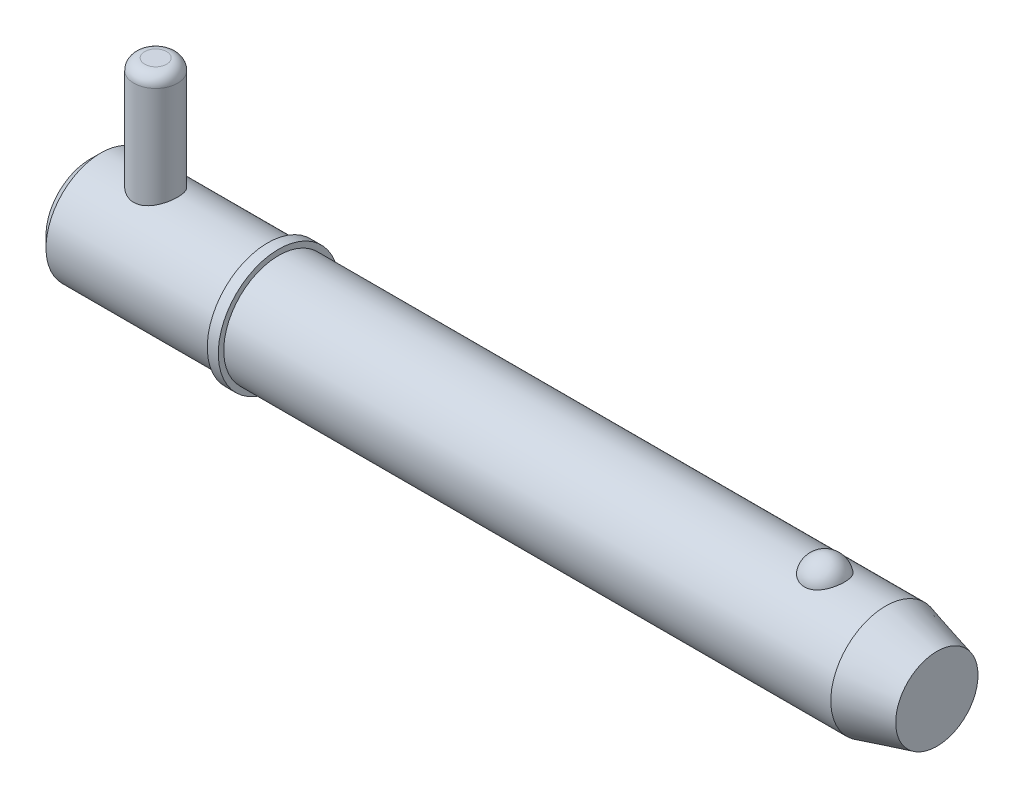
ISO-10303-21;
HEADER;
FILE_DESCRIPTION(('STEP AP214'),'2;1');
FILE_NAME('part.step','',(''),(''),'','','');
FILE_SCHEMA(('AUTOMOTIVE_DESIGN { 1 0 10303 214 1 1 1 1 }'));
ENDSEC;
DATA;
#1=APPLICATION_CONTEXT('core data for automotive mechanical design processes');
#2=APPLICATION_PROTOCOL_DEFINITION('international standard','automotive_design',2000,#1);
#3=PRODUCT_CONTEXT('',#1,'mechanical');
#4=PRODUCT('Part','Part','',(#3));
#5=PRODUCT_RELATED_PRODUCT_CATEGORY('part','',(#4));
#6=PRODUCT_DEFINITION_FORMATION('','',#4);
#7=PRODUCT_DEFINITION_CONTEXT('part definition',#1,'design');
#8=PRODUCT_DEFINITION('design','',#6,#7);
#9=PRODUCT_DEFINITION_SHAPE('','',#8);
#10=(LENGTH_UNIT() NAMED_UNIT(*) SI_UNIT(.MILLI.,.METRE.));
#11=(NAMED_UNIT(*) PLANE_ANGLE_UNIT() SI_UNIT($,.RADIAN.));
#12=(NAMED_UNIT(*) SI_UNIT($,.STERADIAN.) SOLID_ANGLE_UNIT());
#13=UNCERTAINTY_MEASURE_WITH_UNIT(LENGTH_MEASURE(1.E-05),#10,'distance_accuracy_value','');
#14=(GEOMETRIC_REPRESENTATION_CONTEXT(3) GLOBAL_UNCERTAINTY_ASSIGNED_CONTEXT((#13)) GLOBAL_UNIT_ASSIGNED_CONTEXT((#10,
#11,#12)) REPRESENTATION_CONTEXT('',''));
#15=CARTESIAN_POINT('',(0.,0.,0.));
#16=DIRECTION('',(0.,0.,1.));
#17=DIRECTION('',(1.,0.,0.));
#18=AXIS2_PLACEMENT_3D('',#15,#16,#17);
#19=CARTESIAN_POINT('',(9.525,23.81,0.));
#20=DIRECTION('',(0.,-1.,0.));
#21=DIRECTION('',(0.,0.,-1.));
#22=AXIS2_PLACEMENT_3D('',#19,#20,#21);
#23=CYLINDRICAL_SURFACE('',#22,3.175);
#24=CARTESIAN_POINT('',(9.525,-6.3525,0.));
#25=DIRECTION('',(0.,1.,0.));
#26=DIRECTION('',(0.,0.,1.));
#27=AXIS2_PLACEMENT_3D('',#24,#25,#26);
#28=CIRCLE('',#27,3.175);
#29=CARTESIAN_POINT('',(9.525,-6.3525,3.175));
#30=VERTEX_POINT('',#29);
#31=EDGE_CURVE('P0_E25',#30,#30,#28,.T.);
#32=ORIENTED_EDGE('',*,*,#31,.T.);
#33=EDGE_LOOP('',(#32));
#34=FACE_BOUND('',#33,.T.);
#35=CARTESIAN_POINT('',(9.525,22.2225,0.));
#36=DIRECTION('',(0.,1.,0.));
#37=DIRECTION('',(0.,0.,1.));
#38=AXIS2_PLACEMENT_3D('',#35,#36,#37);
#39=CIRCLE('',#38,3.175);
#40=CARTESIAN_POINT('',(9.525,22.2225,3.175));
#41=VERTEX_POINT('',#40);
#42=EDGE_CURVE('P0_E29',#41,#41,#39,.F.);
#43=ORIENTED_EDGE('',*,*,#42,.T.);
#44=EDGE_LOOP('',(#43));
#45=FACE_BOUND('',#44,.T.);
#46=ADVANCED_FACE('P0_F14',(#34,#45),#23,.T.);
#47=CARTESIAN_POINT('',(9.525,23.81,0.));
#48=DIRECTION('',(0.,1.,0.));
#49=DIRECTION('',(0.,0.,1.));
#50=AXIS2_PLACEMENT_3D('',#47,#48,#49);
#51=PLANE('',#50);
#52=CARTESIAN_POINT('',(9.525,23.81,0.));
#53=DIRECTION('',(0.,1.,0.));
#54=DIRECTION('',(0.,0.,1.));
#55=AXIS2_PLACEMENT_3D('',#52,#53,#54);
#56=CIRCLE('',#55,1.5875);
#57=CARTESIAN_POINT('',(9.525,23.81,1.5875));
#58=VERTEX_POINT('',#57);
#59=EDGE_CURVE('P0_E10',#58,#58,#56,.T.);
#60=ORIENTED_EDGE('',*,*,#59,.T.);
#61=EDGE_LOOP('',(#60));
#62=FACE_BOUND('',#61,.T.);
#63=ADVANCED_FACE('P0_F46',(#62),#51,.T.);
#64=CARTESIAN_POINT('',(9.525,-7.94,0.));
#65=DIRECTION('',(0.,1.,0.));
#66=DIRECTION('',(0.,0.,1.));
#67=AXIS2_PLACEMENT_3D('',#64,#65,#66);
#68=PLANE('',#67);
#69=CARTESIAN_POINT('',(9.525,-7.94,0.));
#70=DIRECTION('',(0.,1.,0.));
#71=DIRECTION('',(0.,0.,1.));
#72=AXIS2_PLACEMENT_3D('',#69,#70,#71);
#73=CIRCLE('',#72,1.5875);
#74=CARTESIAN_POINT('',(9.525,-7.94,1.5875));
#75=VERTEX_POINT('',#74);
#76=EDGE_CURVE('P0_E21',#75,#75,#73,.F.);
#77=ORIENTED_EDGE('',*,*,#76,.T.);
#78=EDGE_LOOP('',(#77));
#79=FACE_BOUND('',#78,.T.);
#80=ADVANCED_FACE('P0_F43',(#79),#68,.F.);
#81=CARTESIAN_POINT('',(9.525,-6.3525,0.));
#82=DIRECTION('',(0.,1.,0.));
#83=DIRECTION('',(0.,0.,1.));
#84=AXIS2_PLACEMENT_3D('',#81,#82,#83);
#85=DEGENERATE_TOROIDAL_SURFACE('',#84,1.5875,1.5875,.T.);
#86=ORIENTED_EDGE('',*,*,#76,.F.);
#87=EDGE_LOOP('',(#86));
#88=FACE_BOUND('',#87,.T.);
#89=ORIENTED_EDGE('',*,*,#31,.F.);
#90=EDGE_LOOP('',(#89));
#91=FACE_BOUND('',#90,.T.);
#92=ADVANCED_FACE('P0_F38',(#88,#91),#85,.T.);
#93=CARTESIAN_POINT('',(9.525,22.2225,0.));
#94=DIRECTION('',(0.,1.,0.));
#95=DIRECTION('',(0.,0.,1.));
#96=AXIS2_PLACEMENT_3D('',#93,#94,#95);
#97=DEGENERATE_TOROIDAL_SURFACE('',#96,1.5875,1.5875,.T.);
#98=ORIENTED_EDGE('',*,*,#42,.F.);
#99=EDGE_LOOP('',(#98));
#100=FACE_BOUND('',#99,.T.);
#101=ORIENTED_EDGE('',*,*,#59,.F.);
#102=EDGE_LOOP('',(#101));
#103=FACE_BOUND('',#102,.T.);
#104=ADVANCED_FACE('P0_F16',(#100,#103),#97,.T.);
#105=CLOSED_SHELL('',(#46,#63,#80,#92,#104));
#106=MANIFOLD_SOLID_BREP('P0_B1',#105);
#107=CARTESIAN_POINT('',(0.,0.,0.));
#108=DIRECTION('',(1.,0.,0.));
#109=DIRECTION('',(0.,0.,-1.));
#110=AXIS2_PLACEMENT_3D('',#107,#108,#109);
#111=CYLINDRICAL_SURFACE('',#110,7.94);
#112=CARTESIAN_POINT('',(115.151879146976,0.,0.));
#113=DIRECTION('',(1.,0.,0.));
#114=DIRECTION('',(0.,0.,-1.));
#115=AXIS2_PLACEMENT_3D('',#112,#113,#114);
#116=CIRCLE('',#115,7.94);
#117=CARTESIAN_POINT('',(115.151879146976,0.,-7.94));
#118=VERTEX_POINT('',#117);
#119=EDGE_CURVE('P1_E81',#118,#118,#116,.T.);
#120=ORIENTED_EDGE('',*,*,#119,.F.);
#121=EDGE_LOOP('',(#120));
#122=FACE_BOUND('',#121,.T.);
#123=CARTESIAN_POINT('',(27.31,0.,0.));
#124=DIRECTION('',(1.,0.,0.));
#125=DIRECTION('',(0.,0.,-1.));
#126=AXIS2_PLACEMENT_3D('',#123,#124,#125);
#127=CIRCLE('',#126,7.94);
#128=CARTESIAN_POINT('',(27.31,0.,-7.94));
#129=VERTEX_POINT('',#128);
#130=EDGE_CURVE('P1_E85',#129,#129,#127,.T.);
#131=ORIENTED_EDGE('',*,*,#130,.T.);
#132=EDGE_LOOP('',(#131));
#133=FACE_BOUND('',#132,.T.);
#134=CARTESIAN_POINT('',(106.344907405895,7.37767842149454,2.93486986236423));
#135=CARTESIAN_POINT('',(106.192749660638,7.3776732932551,2.93487505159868));
#136=CARTESIAN_POINT('',(106.040632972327,7.38258419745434,2.92262454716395));
#137=CARTESIAN_POINT('',(105.740928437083,7.40163229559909,2.87404196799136));
#138=CARTESIAN_POINT('',(105.593339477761,7.41576720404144,2.83771585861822));
#139=CARTESIAN_POINT('',(105.307018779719,7.4516157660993,2.74218769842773));
#140=CARTESIAN_POINT('',(105.168274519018,7.47331841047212,2.68301886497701));
#141=CARTESIAN_POINT('',(104.902882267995,7.52194082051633,2.54350967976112));
#142=CARTESIAN_POINT('',(104.776236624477,7.5488615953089,2.46316523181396));
#143=CARTESIAN_POINT('',(104.534534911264,7.60594671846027,2.28090375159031));
#144=CARTESIAN_POINT('',(104.419906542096,7.63618114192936,2.17844211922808));
#145=CARTESIAN_POINT('',(104.208878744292,7.69614046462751,1.95608495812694));
#146=CARTESIAN_POINT('',(104.112482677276,7.72586526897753,1.83618622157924));
#147=CARTESIAN_POINT('',(103.935938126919,7.78314821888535,1.57628086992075));
#148=CARTESIAN_POINT('',(103.856707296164,7.81055035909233,1.43561546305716));
#149=CARTESIAN_POINT('',(103.721797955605,7.85879631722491,1.14236334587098));
#150=CARTESIAN_POINT('',(103.666121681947,7.87963951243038,0.989775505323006));
#151=CARTESIAN_POINT('',(103.57881215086,7.91289645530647,0.67461992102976));
#152=CARTESIAN_POINT('',(103.54753090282,7.925186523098,0.511941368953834));
#153=CARTESIAN_POINT('',(103.510975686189,7.93958930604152,0.183247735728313));
#154=CARTESIAN_POINT('',(103.505701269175,7.94170219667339,0.0172327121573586));
#155=CARTESIAN_POINT('',(103.521231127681,7.93554931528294,-0.312672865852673));
#156=CARTESIAN_POINT('',(103.541925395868,7.92732732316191,-0.476569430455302));
#157=CARTESIAN_POINT('',(103.60878655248,7.90141534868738,-0.798305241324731));
#158=CARTESIAN_POINT('',(103.654953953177,7.88372517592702,-0.956144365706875));
#159=CARTESIAN_POINT('',(103.771898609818,7.84066230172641,-1.26152073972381));
#160=CARTESIAN_POINT('',(103.842704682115,7.81528060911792,-1.40904568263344));
#161=CARTESIAN_POINT('',(104.007478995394,7.7594867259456,-1.68950598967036));
#162=CARTESIAN_POINT('',(104.101448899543,7.72907417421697,-1.82244030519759));
#163=CARTESIAN_POINT('',(104.310839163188,7.66640424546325,-2.07032792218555));
#164=CARTESIAN_POINT('',(104.426315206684,7.63414223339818,-2.1852330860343));
#165=CARTESIAN_POINT('',(104.6759006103,7.57149681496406,-2.39329737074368));
#166=CARTESIAN_POINT('',(104.810008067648,7.54111321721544,-2.48645870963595));
#167=CARTESIAN_POINT('',(105.090111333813,7.48650742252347,-2.64628132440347));
#168=CARTESIAN_POINT('',(105.235760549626,7.46215900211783,-2.71350554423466));
#169=CARTESIAN_POINT('',(105.537425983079,7.42171253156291,-2.82226614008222));
#170=CARTESIAN_POINT('',(105.693438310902,7.40561140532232,-2.86381209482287));
#171=CARTESIAN_POINT('',(106.002970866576,7.3842679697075,-2.91839077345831));
#172=CARTESIAN_POINT('',(106.156222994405,7.37852109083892,-2.93275024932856));
#173=CARTESIAN_POINT('',(106.463070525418,7.37700973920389,-2.93655208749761));
#174=CARTESIAN_POINT('',(106.616665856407,7.38124333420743,-2.92599927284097));
#175=CARTESIAN_POINT('',(106.914990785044,7.39890635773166,-2.88102897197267));
#176=CARTESIAN_POINT('',(107.059848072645,7.41205491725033,-2.8473399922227));
#177=CARTESIAN_POINT('',(107.34164329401,7.445801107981,-2.75788206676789));
#178=CARTESIAN_POINT('',(107.478580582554,7.46639934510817,-2.70211132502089));
#179=CARTESIAN_POINT('',(107.744061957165,7.51339098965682,-2.56858908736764));
#180=CARTESIAN_POINT('',(107.872354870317,7.53990200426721,-2.49038067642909));
#181=CARTESIAN_POINT('',(108.114244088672,7.59569503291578,-2.31462737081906));
#182=CARTESIAN_POINT('',(108.227837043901,7.62497767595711,-2.21707808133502));
#183=CARTESIAN_POINT('',(108.44322156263,7.68489473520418,-1.99982049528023));
#184=CARTESIAN_POINT('',(108.544148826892,7.71552419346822,-1.87925337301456));
#185=CARTESIAN_POINT('',(108.725186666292,7.77353016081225,-1.62268826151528));
#186=CARTESIAN_POINT('',(108.805293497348,7.80090608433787,-1.4866875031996));
#187=CARTESIAN_POINT('',(108.945361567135,7.85047992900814,-1.19818413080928));
#188=CARTESIAN_POINT('',(109.004587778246,7.8724818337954,-1.04529016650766));
#189=CARTESIAN_POINT('',(109.097982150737,7.90785114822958,-0.731080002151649));
#190=CARTESIAN_POINT('',(109.132149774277,7.92121837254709,-0.569763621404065));
#191=CARTESIAN_POINT('',(109.174795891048,7.93797834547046,-0.242812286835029));
#192=CARTESIAN_POINT('',(109.183204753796,7.94134405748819,-0.0771668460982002));
#193=CARTESIAN_POINT('',(109.173962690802,7.93767937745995,0.2532769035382));
#194=CARTESIAN_POINT('',(109.156312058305,7.93064910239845,0.418075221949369));
#195=CARTESIAN_POINT('',(109.095424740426,7.90695571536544,0.74152553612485));
#196=CARTESIAN_POINT('',(109.052281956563,7.8903279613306,0.900197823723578));
#197=CARTESIAN_POINT('',(108.94135358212,7.84916386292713,1.20759654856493));
#198=CARTESIAN_POINT('',(108.87356656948,7.82462706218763,1.35632241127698));
#199=CARTESIAN_POINT('',(108.714371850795,7.7700669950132,1.64032869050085));
#200=CARTESIAN_POINT('',(108.622861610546,7.7400200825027,1.77554712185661));
#201=CARTESIAN_POINT('',(108.418296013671,7.67774175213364,2.02800648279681));
#202=CARTESIAN_POINT('',(108.305241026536,7.64551037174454,2.14524772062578));
#203=CARTESIAN_POINT('',(108.060831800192,7.58265895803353,2.35778002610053));
#204=CARTESIAN_POINT('',(107.929583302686,7.5520309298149,2.45319004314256));
#205=CARTESIAN_POINT('',(107.651601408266,7.49579792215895,2.61999897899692));
#206=CARTESIAN_POINT('',(107.504867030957,7.47019326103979,2.69139637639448));
#207=CARTESIAN_POINT('',(107.192947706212,7.42622216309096,2.8105324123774));
#208=CARTESIAN_POINT('',(107.027220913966,7.40825002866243,2.85700910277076));
#209=CARTESIAN_POINT('',(106.689279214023,7.38398348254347,2.9191685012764));
#210=CARTESIAN_POINT('',(106.51706702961,7.3776842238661,2.93486399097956));
#211=CARTESIAN_POINT('',(106.344907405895,7.37767842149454,2.93486986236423));
#212=B_SPLINE_CURVE_WITH_KNOTS('',3,(#134,#135,#136,#137,#138,#139,#140,#141,#142,#143,#144,
#145,#146,#147,#148,#149,#150,#151,#152,#153,#154,#155,#156,#157,#158,#159,#160,#161,#162,#163,
#164,#165,#166,#167,#168,#169,#170,#171,#172,#173,#174,#175,#176,#177,#178,#179,#180,#181,#182,
#183,#184,#185,#186,#187,#188,#189,#190,#191,#192,#193,#194,#195,#196,#197,#198,#199,#200,#201,
#202,#203,#204,#205,#206,#207,#208,#209,#210,#211),.UNSPECIFIED.,.T.,.F.,(4,2,2,2,2,2,2,2,2,2,2,
2,2,2,2,2,2,2,2,2,2,2,2,2,2,2,2,2,2,2,2,2,2,2,2,2,2,2,4),(0.,0.45584132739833,0.911569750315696,
1.36663794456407,1.8217942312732,2.28978983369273,2.7578716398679,3.246853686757,
3.73588214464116,4.23184282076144,4.72779494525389,5.22165321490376,5.71552141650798,
6.20996917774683,6.70445245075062,7.20023431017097,7.69596557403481,8.18023418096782,
8.66432203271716,9.12410697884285,9.58380291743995,10.0296503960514,10.4755341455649,
10.9312349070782,11.3870393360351,11.8654416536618,12.3439299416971,12.8378875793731,
13.3318558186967,13.8271581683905,14.3224549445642,14.8159385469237,15.3094506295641,
15.8051323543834,16.3008055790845,16.7937101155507,17.2866458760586,17.8026240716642,
18.3183879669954),.UNSPECIFIED.);
#213=CARTESIAN_POINT('',(106.344907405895,7.37767842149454,2.93486986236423));
#214=VERTEX_POINT('',#213);
#215=EDGE_CURVE('P1_E35',#214,#214,#212,.T.);
#216=ORIENTED_EDGE('',*,*,#215,.T.);
#217=EDGE_LOOP('',(#216));
#218=FACE_BOUND('',#217,.T.);
#219=ADVANCED_FACE('P1_F13',(#122,#133,#218),#111,.T.);
#220=CARTESIAN_POINT('',(0.,0.,0.));
#221=DIRECTION('',(-1.,0.,0.));
#222=DIRECTION('',(0.,0.,1.));
#223=AXIS2_PLACEMENT_3D('',#220,#221,#222);
#224=PLANE('',#223);
#225=CARTESIAN_POINT('',(0.,0.,0.));
#226=DIRECTION('',(1.,0.,0.));
#227=DIRECTION('',(0.,0.,-1.));
#228=AXIS2_PLACEMENT_3D('',#225,#226,#227);
#229=CIRCLE('',#228,6.352);
#230=CARTESIAN_POINT('',(0.,0.,-6.352));
#231=VERTEX_POINT('',#230);
#232=EDGE_CURVE('P1_E9',#231,#231,#229,.T.);
#233=ORIENTED_EDGE('',*,*,#232,.F.);
#234=EDGE_LOOP('',(#233));
#235=FACE_BOUND('',#234,.T.);
#236=ADVANCED_FACE('P1_F15',(#235),#224,.T.);
#237=CARTESIAN_POINT('',(1.58799999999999,0.,0.));
#238=DIRECTION('',(1.,0.,0.));
#239=DIRECTION('',(0.,0.,-1.));
#240=AXIS2_PLACEMENT_3D('',#237,#238,#239);
#241=CONICAL_SURFACE('',#240,7.94,0.78539816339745);
#242=ORIENTED_EDGE('',*,*,#232,.T.);
#243=EDGE_LOOP('',(#242));
#244=FACE_BOUND('',#243,.T.);
#245=CARTESIAN_POINT('',(1.58799999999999,0.,0.));
#246=DIRECTION('',(1.,0.,0.));
#247=DIRECTION('',(0.,0.,-1.));
#248=AXIS2_PLACEMENT_3D('',#245,#246,#247);
#249=CIRCLE('',#248,7.94);
#250=CARTESIAN_POINT('',(1.58799999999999,0.,-7.94));
#251=VERTEX_POINT('',#250);
#252=EDGE_CURVE('P1_E26',#251,#251,#249,.T.);
#253=ORIENTED_EDGE('',*,*,#252,.F.);
#254=EDGE_LOOP('',(#253));
#255=FACE_BOUND('',#254,.T.);
#256=ADVANCED_FACE('P1_F77',(#244,#255),#241,.T.);
#257=CARTESIAN_POINT('',(0.,0.,0.));
#258=DIRECTION('',(1.,0.,0.));
#259=DIRECTION('',(0.,0.,-1.));
#260=AXIS2_PLACEMENT_3D('',#257,#258,#259);
#261=CYLINDRICAL_SURFACE('',#260,7.94);
#262=CARTESIAN_POINT('',(9.525,-7.27756655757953,3.175));
#263=CARTESIAN_POINT('',(9.43992346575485,-7.27756715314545,3.17499935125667));
#264=CARTESIAN_POINT('',(9.35481882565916,-7.27906496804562,3.1715736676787));
#265=CARTESIAN_POINT('',(9.18524505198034,-7.28499816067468,3.15791803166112));
#266=CARTESIAN_POINT('',(9.100776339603,-7.28943533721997,3.14768391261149));
#267=CARTESIAN_POINT('',(8.84895715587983,-7.30698881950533,3.10684226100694));
#268=CARTESIAN_POINT('',(8.6834173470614,-7.32434654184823,3.06609574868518));
#269=CARTESIAN_POINT('',(8.36278910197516,-7.36806950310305,2.95945910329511));
#270=CARTESIAN_POINT('',(8.20766386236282,-7.39440078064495,2.89366366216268));
#271=CARTESIAN_POINT('',(7.91065319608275,-7.45304562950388,2.73907413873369));
#272=CARTESIAN_POINT('',(7.76876488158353,-7.48535789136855,2.65028508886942));
#273=CARTESIAN_POINT('',(7.49411086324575,-7.55439482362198,2.44679888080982));
#274=CARTESIAN_POINT('',(7.36219910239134,-7.59126138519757,2.33099745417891));
#275=CARTESIAN_POINT('',(7.11904234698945,-7.66408045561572,2.07909838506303));
#276=CARTESIAN_POINT('',(7.00780457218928,-7.70003264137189,1.94299368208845));
#277=CARTESIAN_POINT('',(6.80492173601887,-7.76867514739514,1.64775981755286));
#278=CARTESIAN_POINT('',(6.71422139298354,-7.80118112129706,1.48793473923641));
#279=CARTESIAN_POINT('',(6.56135788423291,-7.85754918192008,1.15376269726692));
#280=CARTESIAN_POINT('',(6.49918311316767,-7.88141478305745,0.979421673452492));
#281=CARTESIAN_POINT('',(6.40818142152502,-7.91680873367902,0.630115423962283));
#282=CARTESIAN_POINT('',(6.3778864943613,-7.9288781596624,0.455588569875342));
#283=CARTESIAN_POINT('',(6.34677743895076,-7.94127547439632,0.103539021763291));
#284=CARTESIAN_POINT('',(6.34595232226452,-7.94160773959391,-0.0739825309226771));
#285=CARTESIAN_POINT('',(6.37300128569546,-7.93082261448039,-0.416371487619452));
#286=CARTESIAN_POINT('',(6.39926693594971,-7.92034690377,-0.581389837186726));
#287=CARTESIAN_POINT('',(6.47701615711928,-7.88998770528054,-0.904449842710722));
#288=CARTESIAN_POINT('',(6.52850157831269,-7.87010352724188,-1.06249098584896));
#289=CARTESIAN_POINT('',(6.65586120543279,-7.82249343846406,-1.36995769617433));
#290=CARTESIAN_POINT('',(6.73209124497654,-7.79465387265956,-1.51921754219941));
#291=CARTESIAN_POINT('',(6.90644286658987,-7.73389606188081,-1.80321183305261));
#292=CARTESIAN_POINT('',(7.00457194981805,-7.70097607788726,-1.93794127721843));
#293=CARTESIAN_POINT('',(7.22744086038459,-7.63084889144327,-2.19843606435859));
#294=CARTESIAN_POINT('',(7.35350432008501,-7.59350211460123,-2.3230330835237));
#295=CARTESIAN_POINT('',(7.62488266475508,-7.52039654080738,-2.54979642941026));
#296=CARTESIAN_POINT('',(7.77020381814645,-7.48463826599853,-2.65195542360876));
#297=CARTESIAN_POINT('',(8.08119298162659,-7.41780943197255,-2.83361305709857));
#298=CARTESIAN_POINT('',(8.24731937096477,-7.38689959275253,-2.91239105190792));
#299=CARTESIAN_POINT('',(8.59204539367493,-7.33515216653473,-3.04038913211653));
#300=CARTESIAN_POINT('',(8.77063684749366,-7.31430804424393,-3.08962840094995));
#301=CARTESIAN_POINT('',(9.12356982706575,-7.28663831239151,-3.15431018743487));
#302=CARTESIAN_POINT('',(9.29750494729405,-7.2790344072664,-3.17163284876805));
#303=CARTESIAN_POINT('',(9.64592502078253,-7.27648884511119,-3.17747282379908));
#304=CARTESIAN_POINT('',(9.82040979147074,-7.28154335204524,-3.16599886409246));
#305=CARTESIAN_POINT('',(10.1545374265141,-7.30294638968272,-3.11628310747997));
#306=CARTESIAN_POINT('',(10.3144598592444,-7.31863587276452,-3.0796016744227));
#307=CARTESIAN_POINT('',(10.625774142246,-7.35872371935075,-2.98253618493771));
#308=CARTESIAN_POINT('',(10.7771640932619,-7.38312401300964,-2.92214687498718));
#309=CARTESIAN_POINT('',(11.0739599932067,-7.4390944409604,-2.77664664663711));
#310=CARTESIAN_POINT('',(11.2188745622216,-7.47091513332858,-2.69063278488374));
#311=CARTESIAN_POINT('',(11.4928722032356,-7.53775867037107,-2.49724834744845));
#312=CARTESIAN_POINT('',(11.6219487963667,-7.57278281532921,-2.38986907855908));
#313=CARTESIAN_POINT('',(11.8705091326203,-7.64520845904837,-2.1474449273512));
#314=CARTESIAN_POINT('',(11.9885816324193,-7.68259462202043,-2.01094304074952));
#315=CARTESIAN_POINT('',(12.2003631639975,-7.75309951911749,-1.71917041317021));
#316=CARTESIAN_POINT('',(12.2940712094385,-7.78621808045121,-1.56389891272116));
#317=CARTESIAN_POINT('',(12.4541161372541,-7.84456050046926,-1.23845027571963));
#318=CARTESIAN_POINT('',(12.5204600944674,-7.86978639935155,-1.06827700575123));
#319=CARTESIAN_POINT('',(12.6231407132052,-7.90943635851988,-0.717928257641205));
#320=CARTESIAN_POINT('',(12.6594936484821,-7.92386627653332,-0.537758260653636));
#321=CARTESIAN_POINT('',(12.6992281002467,-7.93967263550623,-0.185201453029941));
#322=CARTESIAN_POINT('',(12.7046050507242,-7.94183891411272,-0.0130732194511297));
#323=CARTESIAN_POINT('',(12.6875036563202,-7.9350072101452,0.329549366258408));
#324=CARTESIAN_POINT('',(12.6650295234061,-7.92601091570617,0.500043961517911));
#325=CARTESIAN_POINT('',(12.5942896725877,-7.89825976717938,0.829196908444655));
#326=CARTESIAN_POINT('',(12.5468364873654,-7.87981280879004,0.988057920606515));
#327=CARTESIAN_POINT('',(12.4283390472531,-7.83513565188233,1.29553461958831));
#328=CARTESIAN_POINT('',(12.3572904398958,-7.8089040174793,1.44414841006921));
#329=CARTESIAN_POINT('',(12.1900822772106,-7.7497911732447,1.73412879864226));
#330=CARTESIAN_POINT('',(12.0929519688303,-7.71666737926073,1.87488510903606));
#331=CARTESIAN_POINT('',(11.8777894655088,-7.64775894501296,2.13869231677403));
#332=CARTESIAN_POINT('',(11.7597486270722,-7.61197320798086,2.26173585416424));
#333=CARTESIAN_POINT('',(11.4974896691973,-7.53902341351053,2.49449755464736));
#334=CARTESIAN_POINT('',(11.3521039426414,-7.50191102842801,2.60292060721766));
#335=CARTESIAN_POINT('',(11.0440201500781,-7.43289551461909,2.79392602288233));
#336=CARTESIAN_POINT('',(10.8813200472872,-7.40099299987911,2.87650534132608));
#337=CARTESIAN_POINT('',(10.558064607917,-7.3489506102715,3.00682739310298));
#338=CARTESIAN_POINT('',(10.398627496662,-7.32801197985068,3.05703164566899));
#339=CARTESIAN_POINT('',(10.0731242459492,-7.29639491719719,3.13175843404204));
#340=CARTESIAN_POINT('',(9.90707793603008,-7.28568789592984,3.15635254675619));
#341=CARTESIAN_POINT('',(9.70441566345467,-7.27968826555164,3.17013149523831));
#342=CARTESIAN_POINT('',(9.66856669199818,-7.27889378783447,3.17195593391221));
#343=CARTESIAN_POINT('',(9.59681348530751,-7.27783278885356,3.17439036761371));
#344=CARTESIAN_POINT('',(9.56090924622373,-7.27756630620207,3.17500027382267));
#345=CARTESIAN_POINT('',(9.525,-7.27756655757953,3.175));
#346=B_SPLINE_CURVE_WITH_KNOTS('',3,(#262,#263,#264,#265,#266,#267,#268,#269,#270,#271,#272,
#273,#274,#275,#276,#277,#278,#279,#280,#281,#282,#283,#284,#285,#286,#287,#288,#289,#290,#291,
#292,#293,#294,#295,#296,#297,#298,#299,#300,#301,#302,#303,#304,#305,#306,#307,#308,#309,#310,
#311,#312,#313,#314,#315,#316,#317,#318,#319,#320,#321,#322,#323,#324,#325,#326,#327,#328,#329,
#330,#331,#332,#333,#334,#335,#336,#337,#338,#339,#340,#341,#342,#343,#344,#345),.UNSPECIFIED.,
.T.,.F.,(4,2,2,2,2,2,2,2,2,2,2,2,2,2,2,2,2,2,2,2,2,2,2,2,2,2,2,2,2,2,2,2,2,2,2,2,2,2,2,2,2,4),
(0.,0.255187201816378,0.510530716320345,1.0218798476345,1.53131482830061,2.04063840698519,
2.57635929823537,3.11226692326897,3.66929090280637,4.22608806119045,4.75594400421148,
5.28560237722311,5.78552836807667,6.28549104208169,6.79298787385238,7.30065880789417,
7.8416422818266,8.38280228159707,8.93923025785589,9.49529647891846,10.0174074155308,
10.5393601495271,11.0316114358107,11.5239718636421,12.0362920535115,12.5488211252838,
13.0991799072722,13.6495609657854,14.1997996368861,14.7497395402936,15.2638187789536,
15.7778202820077,16.2760504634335,16.7743726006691,17.294711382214,17.8152657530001,
18.3680208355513,18.9208410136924,19.4240423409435,19.9258334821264,20.0335354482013,
20.1412452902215),.UNSPECIFIED.);
#347=CARTESIAN_POINT('',(9.525,-7.27756655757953,3.175));
#348=VERTEX_POINT('',#347);
#349=EDGE_CURVE('P1_E17',#348,#348,#346,.T.);
#350=ORIENTED_EDGE('',*,*,#349,.F.);
#351=EDGE_LOOP('',(#350));
#352=FACE_BOUND('',#351,.T.);
#353=CARTESIAN_POINT('',(9.525,7.27756655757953,3.175));
#354=CARTESIAN_POINT('',(9.61007653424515,7.27756715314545,3.17499935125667));
#355=CARTESIAN_POINT('',(9.69518117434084,7.27906496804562,3.1715736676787));
#356=CARTESIAN_POINT('',(9.86475494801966,7.28499816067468,3.15791803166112));
#357=CARTESIAN_POINT('',(9.949223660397,7.28943533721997,3.14768391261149));
#358=CARTESIAN_POINT('',(10.2010428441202,7.30698881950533,3.10684226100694));
#359=CARTESIAN_POINT('',(10.3665826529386,7.32434654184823,3.06609574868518));
#360=CARTESIAN_POINT('',(10.6872108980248,7.36806950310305,2.95945910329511));
#361=CARTESIAN_POINT('',(10.8423361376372,7.39440078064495,2.89366366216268));
#362=CARTESIAN_POINT('',(11.1393468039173,7.45304562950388,2.73907413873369));
#363=CARTESIAN_POINT('',(11.2812351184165,7.48535789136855,2.65028508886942));
#364=CARTESIAN_POINT('',(11.5558891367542,7.55439482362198,2.44679888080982));
#365=CARTESIAN_POINT('',(11.6878008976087,7.59126138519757,2.33099745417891));
#366=CARTESIAN_POINT('',(11.9309576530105,7.66408045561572,2.07909838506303));
#367=CARTESIAN_POINT('',(12.0421954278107,7.70003264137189,1.94299368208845));
#368=CARTESIAN_POINT('',(12.2450782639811,7.76867514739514,1.64775981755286));
#369=CARTESIAN_POINT('',(12.3357786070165,7.80118112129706,1.48793473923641));
#370=CARTESIAN_POINT('',(12.4886421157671,7.85754918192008,1.15376269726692));
#371=CARTESIAN_POINT('',(12.5508168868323,7.88141478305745,0.979421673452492));
#372=CARTESIAN_POINT('',(12.641818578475,7.91680873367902,0.630115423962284));
#373=CARTESIAN_POINT('',(12.6721135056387,7.9288781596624,0.455588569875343));
#374=CARTESIAN_POINT('',(12.7032225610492,7.94127547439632,0.103539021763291));
#375=CARTESIAN_POINT('',(12.7040476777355,7.94160773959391,-0.0739825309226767));
#376=CARTESIAN_POINT('',(12.6769987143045,7.93082261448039,-0.416371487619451));
#377=CARTESIAN_POINT('',(12.6507330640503,7.92034690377,-0.581389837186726));
#378=CARTESIAN_POINT('',(12.5729838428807,7.88998770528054,-0.904449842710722));
#379=CARTESIAN_POINT('',(12.5214984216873,7.87010352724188,-1.06249098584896));
#380=CARTESIAN_POINT('',(12.3941387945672,7.82249343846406,-1.36995769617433));
#381=CARTESIAN_POINT('',(12.3179087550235,7.79465387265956,-1.51921754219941));
#382=CARTESIAN_POINT('',(12.1435571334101,7.73389606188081,-1.80321183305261));
#383=CARTESIAN_POINT('',(12.0454280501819,7.70097607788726,-1.93794127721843));
#384=CARTESIAN_POINT('',(11.8225591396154,7.63084889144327,-2.19843606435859));
#385=CARTESIAN_POINT('',(11.696495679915,7.59350211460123,-2.3230330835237));
#386=CARTESIAN_POINT('',(11.4251173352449,7.52039654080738,-2.54979642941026));
#387=CARTESIAN_POINT('',(11.2797961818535,7.48463826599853,-2.65195542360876));
#388=CARTESIAN_POINT('',(10.9688070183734,7.41780943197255,-2.83361305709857));
#389=CARTESIAN_POINT('',(10.8026806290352,7.38689959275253,-2.91239105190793));
#390=CARTESIAN_POINT('',(10.4579546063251,7.33515216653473,-3.04038913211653));
#391=CARTESIAN_POINT('',(10.2793631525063,7.31430804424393,-3.08962840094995));
#392=CARTESIAN_POINT('',(9.92643017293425,7.28663831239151,-3.15431018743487));
#393=CARTESIAN_POINT('',(9.75249505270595,7.2790344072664,-3.17163284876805));
#394=CARTESIAN_POINT('',(9.40407497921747,7.2764888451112,-3.17747282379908));
#395=CARTESIAN_POINT('',(9.22959020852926,7.28154335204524,-3.16599886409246));
#396=CARTESIAN_POINT('',(8.89546257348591,7.30294638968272,-3.11628310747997));
#397=CARTESIAN_POINT('',(8.73554014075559,7.31863587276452,-3.0796016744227));
#398=CARTESIAN_POINT('',(8.42422585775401,7.35872371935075,-2.98253618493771));
#399=CARTESIAN_POINT('',(8.27283590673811,7.38312401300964,-2.92214687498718));
#400=CARTESIAN_POINT('',(7.97604000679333,7.4390944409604,-2.77664664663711));
#401=CARTESIAN_POINT('',(7.83112543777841,7.47091513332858,-2.69063278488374));
#402=CARTESIAN_POINT('',(7.55712779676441,7.53775867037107,-2.49724834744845));
#403=CARTESIAN_POINT('',(7.42805120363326,7.57278281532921,-2.38986907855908));
#404=CARTESIAN_POINT('',(7.17949086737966,7.64520845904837,-2.1474449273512));
#405=CARTESIAN_POINT('',(7.06141836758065,7.68259462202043,-2.01094304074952));
#406=CARTESIAN_POINT('',(6.8496368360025,7.75309951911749,-1.71917041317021));
#407=CARTESIAN_POINT('',(6.75592879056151,7.78621808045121,-1.56389891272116));
#408=CARTESIAN_POINT('',(6.59588386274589,7.84456050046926,-1.23845027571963));
#409=CARTESIAN_POINT('',(6.52953990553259,7.86978639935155,-1.06827700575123));
#410=CARTESIAN_POINT('',(6.42685928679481,7.90943635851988,-0.717928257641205));
#411=CARTESIAN_POINT('',(6.39050635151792,7.92386627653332,-0.537758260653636));
#412=CARTESIAN_POINT('',(6.35077189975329,7.93967263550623,-0.18520145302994));
#413=CARTESIAN_POINT('',(6.34539494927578,7.94183891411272,-0.0130732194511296));
#414=CARTESIAN_POINT('',(6.36249634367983,7.9350072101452,0.329549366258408));
#415=CARTESIAN_POINT('',(6.38497047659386,7.92601091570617,0.500043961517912));
#416=CARTESIAN_POINT('',(6.45571032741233,7.89825976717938,0.829196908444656));
#417=CARTESIAN_POINT('',(6.50316351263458,7.87981280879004,0.988057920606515));
#418=CARTESIAN_POINT('',(6.62166095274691,7.83513565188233,1.29553461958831));
#419=CARTESIAN_POINT('',(6.69270956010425,7.8089040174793,1.44414841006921));
#420=CARTESIAN_POINT('',(6.85991772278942,7.7497911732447,1.73412879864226));
#421=CARTESIAN_POINT('',(6.95704803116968,7.71666737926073,1.87488510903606));
#422=CARTESIAN_POINT('',(7.17221053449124,7.64775894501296,2.13869231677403));
#423=CARTESIAN_POINT('',(7.29025137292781,7.61197320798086,2.26173585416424));
#424=CARTESIAN_POINT('',(7.55251033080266,7.53902341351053,2.49449755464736));
#425=CARTESIAN_POINT('',(7.69789605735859,7.50191102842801,2.60292060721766));
#426=CARTESIAN_POINT('',(8.00597984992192,7.43289551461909,2.79392602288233));
#427=CARTESIAN_POINT('',(8.16867995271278,7.40099299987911,2.87650534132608));
#428=CARTESIAN_POINT('',(8.49193539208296,7.3489506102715,3.00682739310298));
#429=CARTESIAN_POINT('',(8.65137250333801,7.32801197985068,3.05703164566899));
#430=CARTESIAN_POINT('',(8.97687575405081,7.29639491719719,3.13175843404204));
#431=CARTESIAN_POINT('',(9.14292206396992,7.28568789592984,3.15635254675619));
#432=CARTESIAN_POINT('',(9.34558433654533,7.27968826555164,3.17013149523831));
#433=CARTESIAN_POINT('',(9.38143330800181,7.27889378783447,3.17195593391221));
#434=CARTESIAN_POINT('',(9.45318651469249,7.27783278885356,3.17439036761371));
#435=CARTESIAN_POINT('',(9.48909075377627,7.27756630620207,3.17500027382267));
#436=CARTESIAN_POINT('',(9.525,7.27756655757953,3.175));
#437=B_SPLINE_CURVE_WITH_KNOTS('',3,(#353,#354,#355,#356,#357,#358,#359,#360,#361,#362,#363,
#364,#365,#366,#367,#368,#369,#370,#371,#372,#373,#374,#375,#376,#377,#378,#379,#380,#381,#382,
#383,#384,#385,#386,#387,#388,#389,#390,#391,#392,#393,#394,#395,#396,#397,#398,#399,#400,#401,
#402,#403,#404,#405,#406,#407,#408,#409,#410,#411,#412,#413,#414,#415,#416,#417,#418,#419,#420,
#421,#422,#423,#424,#425,#426,#427,#428,#429,#430,#431,#432,#433,#434,#435,#436),.UNSPECIFIED.,
.T.,.F.,(4,2,2,2,2,2,2,2,2,2,2,2,2,2,2,2,2,2,2,2,2,2,2,2,2,2,2,2,2,2,2,2,2,2,2,2,2,2,2,2,2,4),
(0.,0.255187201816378,0.510530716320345,1.0218798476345,1.53131482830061,2.04063840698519,
2.57635929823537,3.11226692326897,3.66929090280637,4.22608806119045,4.75594400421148,
5.2856023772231,5.78552836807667,6.28549104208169,6.79298787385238,7.30065880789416,
7.8416422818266,8.38280228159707,8.9392302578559,9.49529647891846,10.0174074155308,
10.5393601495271,11.0316114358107,11.5239718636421,12.0362920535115,12.5488211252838,
13.0991799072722,13.6495609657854,14.1997996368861,14.7497395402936,15.2638187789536,
15.7778202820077,16.2760504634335,16.7743726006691,17.294711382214,17.8152657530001,
18.3680208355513,18.9208410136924,19.4240423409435,19.9258334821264,20.0335354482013,
20.1412452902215),.UNSPECIFIED.);
#438=CARTESIAN_POINT('',(9.525,7.27756655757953,3.175));
#439=VERTEX_POINT('',#438);
#440=EDGE_CURVE('P1_E43',#439,#439,#437,.T.);
#441=ORIENTED_EDGE('',*,*,#440,.F.);
#442=EDGE_LOOP('',(#441));
#443=FACE_BOUND('',#442,.T.);
#444=ORIENTED_EDGE('',*,*,#252,.T.);
#445=EDGE_LOOP('',(#444));
#446=FACE_BOUND('',#445,.T.);
#447=CARTESIAN_POINT('',(25.722,0.,0.));
#448=DIRECTION('',(1.,0.,0.));
#449=DIRECTION('',(0.,0.,-1.));
#450=AXIS2_PLACEMENT_3D('',#447,#448,#449);
#451=CIRCLE('',#450,7.94);
#452=CARTESIAN_POINT('',(25.722,0.,-7.94));
#453=VERTEX_POINT('',#452);
#454=EDGE_CURVE('P1_E31',#453,#453,#451,.T.);
#455=ORIENTED_EDGE('',*,*,#454,.F.);
#456=EDGE_LOOP('',(#455));
#457=FACE_BOUND('',#456,.T.);
#458=ADVANCED_FACE('P1_F103',(#352,#443,#446,#457),#261,.T.);
#459=CARTESIAN_POINT('',(25.722,7.94,0.));
#460=DIRECTION('',(-1.,0.,0.));
#461=DIRECTION('',(0.,0.,1.));
#462=AXIS2_PLACEMENT_3D('',#459,#460,#461);
#463=PLANE('',#462);
#464=ORIENTED_EDGE('',*,*,#454,.T.);
#465=EDGE_LOOP('',(#464));
#466=FACE_BOUND('',#465,.T.);
#467=CARTESIAN_POINT('',(25.722,0.,0.));
#468=DIRECTION('',(1.,0.,0.));
#469=DIRECTION('',(0.,0.,-1.));
#470=AXIS2_PLACEMENT_3D('',#467,#468,#469);
#471=CIRCLE('',#470,8.734);
#472=CARTESIAN_POINT('',(25.722,0.,-8.734));
#473=VERTEX_POINT('',#472);
#474=EDGE_CURVE('P1_E91',#473,#473,#471,.T.);
#475=ORIENTED_EDGE('',*,*,#474,.F.);
#476=EDGE_LOOP('',(#475));
#477=FACE_BOUND('',#476,.T.);
#478=ADVANCED_FACE('P1_F100',(#466,#477),#463,.T.);
#479=CARTESIAN_POINT('',(0.,0.,0.));
#480=DIRECTION('',(1.,0.,0.));
#481=DIRECTION('',(0.,0.,-1.));
#482=AXIS2_PLACEMENT_3D('',#479,#480,#481);
#483=CYLINDRICAL_SURFACE('',#482,8.734);
#484=ORIENTED_EDGE('',*,*,#474,.T.);
#485=EDGE_LOOP('',(#484));
#486=FACE_BOUND('',#485,.T.);
#487=CARTESIAN_POINT('',(27.31,0.,0.));
#488=DIRECTION('',(1.,0.,0.));
#489=DIRECTION('',(0.,0.,-1.));
#490=AXIS2_PLACEMENT_3D('',#487,#488,#489);
#491=CIRCLE('',#490,8.734);
#492=CARTESIAN_POINT('',(27.31,0.,-8.734));
#493=VERTEX_POINT('',#492);
#494=EDGE_CURVE('P1_E88',#493,#493,#491,.T.);
#495=ORIENTED_EDGE('',*,*,#494,.F.);
#496=EDGE_LOOP('',(#495));
#497=FACE_BOUND('',#496,.T.);
#498=ADVANCED_FACE('P1_F68',(#486,#497),#483,.T.);
#499=CARTESIAN_POINT('',(27.31,8.734,0.));
#500=DIRECTION('',(1.,0.,0.));
#501=DIRECTION('',(0.,0.,-1.));
#502=AXIS2_PLACEMENT_3D('',#499,#500,#501);
#503=PLANE('',#502);
#504=ORIENTED_EDGE('',*,*,#494,.T.);
#505=EDGE_LOOP('',(#504));
#506=FACE_BOUND('',#505,.T.);
#507=ORIENTED_EDGE('',*,*,#130,.F.);
#508=EDGE_LOOP('',(#507));
#509=FACE_BOUND('',#508,.T.);
#510=ADVANCED_FACE('P1_F62',(#506,#509),#503,.T.);
#511=CARTESIAN_POINT('',(122.56,0.,0.));
#512=DIRECTION('',(-1.,0.,0.));
#513=DIRECTION('',(0.,0.,1.));
#514=AXIS2_PLACEMENT_3D('',#511,#512,#513);
#515=CONICAL_SURFACE('',#514,5.95500000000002,0.26179938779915);
#516=ORIENTED_EDGE('',*,*,#119,.T.);
#517=EDGE_LOOP('',(#516));
#518=FACE_BOUND('',#517,.T.);
#519=CARTESIAN_POINT('',(122.56,0.,0.));
#520=DIRECTION('',(1.,0.,0.));
#521=DIRECTION('',(0.,0.,-1.));
#522=AXIS2_PLACEMENT_3D('',#519,#520,#521);
#523=CIRCLE('',#522,5.95500000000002);
#524=CARTESIAN_POINT('',(122.56,0.,-5.95500000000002));
#525=VERTEX_POINT('',#524);
#526=EDGE_CURVE('P1_E42',#525,#525,#523,.T.);
#527=ORIENTED_EDGE('',*,*,#526,.F.);
#528=EDGE_LOOP('',(#527));
#529=FACE_BOUND('',#528,.T.);
#530=ADVANCED_FACE('P1_F59',(#518,#529),#515,.T.);
#531=CARTESIAN_POINT('',(122.56,5.95500000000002,0.));
#532=DIRECTION('',(1.,0.,0.));
#533=DIRECTION('',(0.,0.,-1.));
#534=AXIS2_PLACEMENT_3D('',#531,#532,#533);
#535=PLANE('',#534);
#536=ORIENTED_EDGE('',*,*,#526,.T.);
#537=EDGE_LOOP('',(#536));
#538=FACE_BOUND('',#537,.T.);
#539=ADVANCED_FACE('P1_F55',(#538),#535,.T.);
#540=CARTESIAN_POINT('',(106.344907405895,7.146,0.));
#541=DIRECTION('',(-1.,0.,0.));
#542=DIRECTION('',(0.,1.,0.));
#543=AXIS2_PLACEMENT_3D('',#540,#541,#542);
#544=SPHERICAL_SURFACE('',#543,2.944);
#545=ORIENTED_EDGE('',*,*,#215,.F.);
#546=EDGE_LOOP('',(#545));
#547=FACE_BOUND('',#546,.T.);
#548=ADVANCED_FACE('P1_F50',(#547),#544,.T.);
#549=CARTESIAN_POINT('',(9.525,-8.734,0.));
#550=DIRECTION('',(0.,1.,0.));
#551=DIRECTION('',(0.,0.,1.));
#552=AXIS2_PLACEMENT_3D('',#549,#550,#551);
#553=CYLINDRICAL_SURFACE('',#552,3.175);
#554=ORIENTED_EDGE('',*,*,#349,.T.);
#555=EDGE_LOOP('',(#554));
#556=FACE_BOUND('',#555,.T.);
#557=ORIENTED_EDGE('',*,*,#440,.T.);
#558=EDGE_LOOP('',(#557));
#559=FACE_BOUND('',#558,.T.);
#560=ADVANCED_FACE('P1_F54',(#556,#559),#553,.F.);
#561=CLOSED_SHELL('',(#219,#236,#256,#458,#478,#498,#510,#530,#539,#548,#560));
#562=MANIFOLD_SOLID_BREP('P1_B1',#561);
#563=ADVANCED_BREP_SHAPE_REPRESENTATION('',(#18,#106,#562),#14);
#564=SHAPE_DEFINITION_REPRESENTATION(#9,#563);
ENDSEC;
END-ISO-10303-21;
